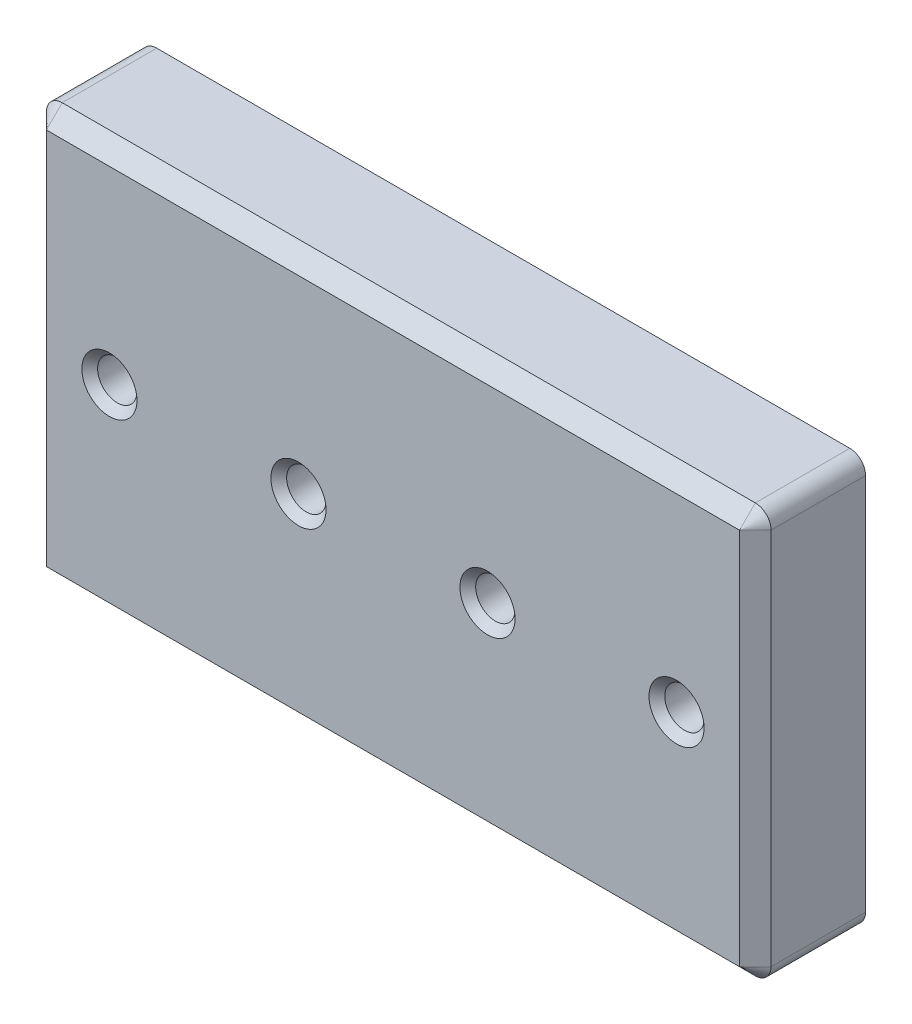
from build123d import *

# Parameters (mm, degrees)
SKETCH1_W           = 46
SKETCH1_H           = 26
SKETCH1_R           = 1.25
BOSS_EXTRUDE1_DEPTH = 7
CHAMFER1_SIZE       = 0.5
FILLET1_R           = 1
CHAMFER2_SIZE       = 1


with BuildPart() as part:
    # Sketch1 → Boss-Extrude1 (new body)
    with BuildSketch(Plane.XY):
        Rectangle(SKETCH1_W, SKETCH1_H)
        with Locations((-18, 0)):
            Circle(SKETCH1_R, mode=Mode.SUBTRACT)
        with Locations((18, 0)):
            Circle(SKETCH1_R, mode=Mode.SUBTRACT)
        with Locations((6, 0)):
            Circle(SKETCH1_R, mode=Mode.SUBTRACT)
        with Locations((-6, 0)):
            Circle(SKETCH1_R, mode=Mode.SUBTRACT)
    extrude(amount=BOSS_EXTRUDE1_DEPTH)

    # Chamfer1
    chamfer1_edges = [part.edges().sort_by_distance(p)[0] for p in [
        (-19.25, 0, 7),
        (16.75, 0, 7),
        (4.75, 0, 7),
        (-7.25, 0, 7),
    ]]
    chamfer(chamfer1_edges, length=CHAMFER1_SIZE)

    # Fillet1
    fillet1_edges = [part.edges().sort_by_distance(p)[0] for p in [
        (-23, 13, 3.5),
        (23, 13, 3.5),
        (23, -13, 3.5),
        (-23, -13, 3.5),
    ]]
    fillet(fillet1_edges, radius=FILLET1_R)

    # Chamfer2
    chamfer2_edges = [part.edges().sort_by_distance(p)[0] for p in [
        (-23, 0, 7),
        (0, 13, 7),
        (0, -13, 7),
        (23, 0, 7),
        (-22.707106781, -12.707106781, 7),
        (22.707106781, -12.707106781, 7),
        (22.707106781, 12.707106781, 7),
        (-22.707106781, 12.707106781, 7),
    ]]
    chamfer(chamfer2_edges, length=CHAMFER2_SIZE)


solid = part.part
